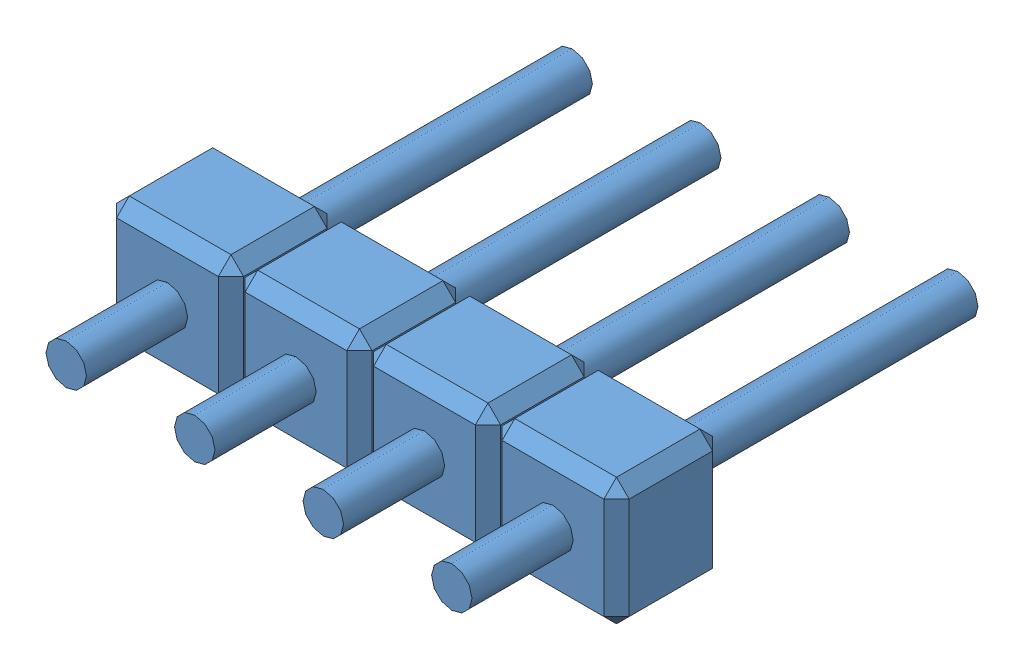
SolidWorks assembly ASB 3PICOTS.SLDASM, configuration Default (file format 4700). Lengths in mm.
Overall size (10.13 2.51 10).
4 component instances, 1 part files, 6 mates.
Components (placement in the parent):
- PICOT-1: PICOT.SLDPRT [Default] at (26.8516 -23.7306 1.953) size (2.51 2.51 10)
- PICOT-2: PICOT.SLDPRT [Default] at (29.3916 -23.7306 1.953) size (2.51 2.51 10)
- PICOT-3: PICOT.SLDPRT [Default] at (24.3116 -23.7306 1.953) size (2.51 2.51 10)
- PICOT-4: PICOT.SLDPRT [Default] at (21.7716 -23.7306 1.953) size (2.51 2.51 10)
Mates (geometry in assembly coordinates):
- Coïncidente4: coincident aligned: plane of PICOT-1 through (-3.6488 -1.9209 4.103) normal (0 -1 0); plane of PICOT-2 through (-1.1088 -1.9209 4.103) normal (0 -1 0)
- Coïncidente5: coincident aligned: plane of PICOT-1 through (-3.6488 -1.9209 4.103) normal (0 0 1); plane of PICOT-2 through (-1.1088 -1.9209 4.103) normal (0 0 1)
- Distance1: distance = 0.03 mm anti-aligned: plane of PICOT-1 through (-1.1388 0.5891 4.103) normal (1 0 0); plane of PICOT-2 through (-1.1088 0.5891 4.103) normal (-1 0 0)
- Coïncidente6: coincident aligned: plane of PICOT-1 through (-3.6488 0.5891 4.103) normal (0 1 0); plane of PICOT-3 through (-6.1888 0.5891 4.103) normal (0 1 0)
- Coïncidente7: coincident aligned: plane of PICOT-1 through (-3.6488 -1.9209 1.953) normal (0 0 -1); plane of PICOT-3 through (-6.1888 -1.9209 1.953) normal (0 0 -1)
- Distance2: distance = 0.03 mm anti-aligned: plane of PICOT-1 through (-3.6488 0.5891 4.103) normal (-1 0 0); plane of PICOT-3 through (-3.6788 0.5891 4.103) normal (1 0 0)
